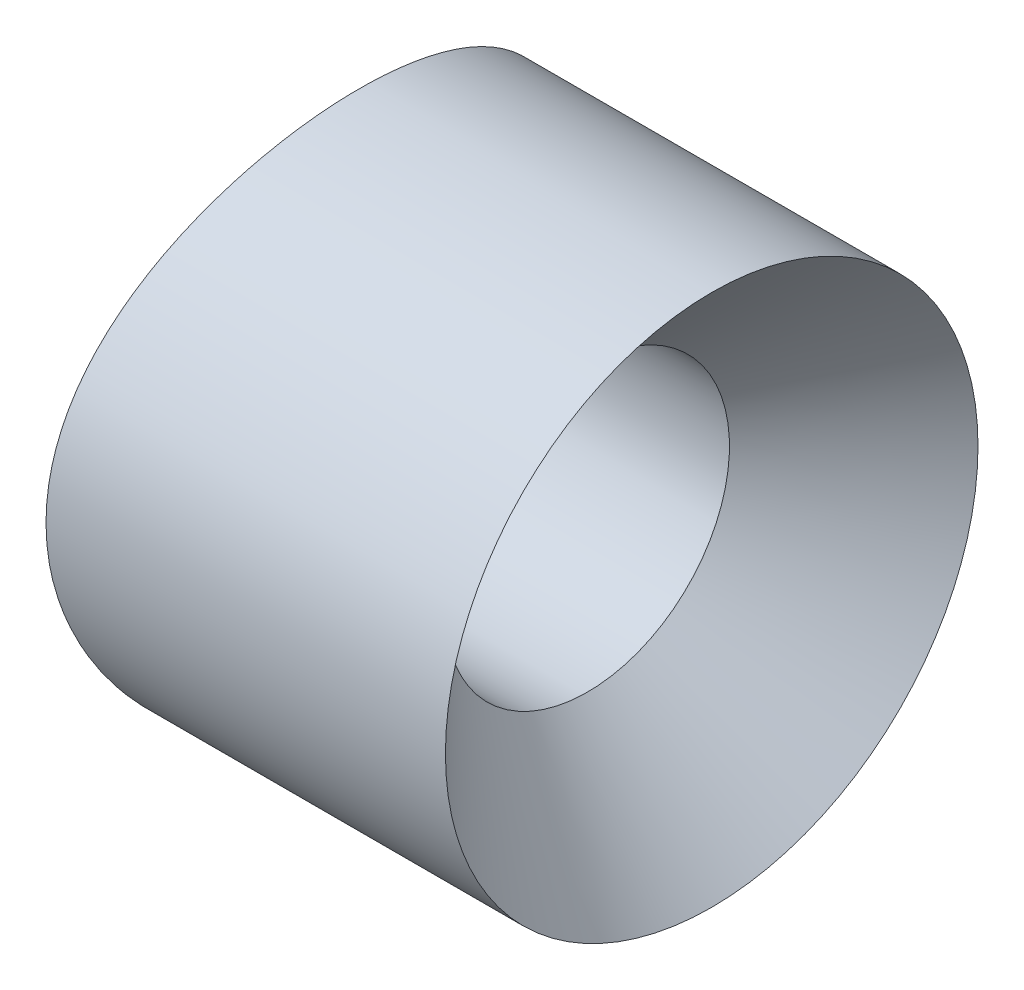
from build123d import *

# Parameters (mm, degrees)
LINEAR_AUSTRAGEN1_DEPTH = 23.5


with BuildPart() as part:
    # Skizze1 → Rotation1 (revolve)
    with BuildSketch(Plane.XY, mode=Mode.PRIVATE) as rotation1_sk:
        Polygon((0, 3), (4.5, 3), (3.1, 1.6), (0, 1.6), align=None)
    revolve(rotation1_sk.sketch.rotate(Axis((0, 0, 0), (1, 0, 0)), 90), axis=Axis((0, 0, 0), (1, 0, 0)))

    # Skizze2 → Linear austragen1 (cut, symmetric)
    with BuildSketch(Plane(origin=(0, 0, 0), x_dir=(0, 0, -1), z_dir=(0, 1, 0))):
        with BuildLine():
            Line((-3, 0), (3, 0))
            ThreePointArc((3, 0), (0, -0.527152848), (-3, 0))
        make_face()
    extrude(amount=LINEAR_AUSTRAGEN1_DEPTH, both=True, mode=Mode.SUBTRACT)


solid = part.part
